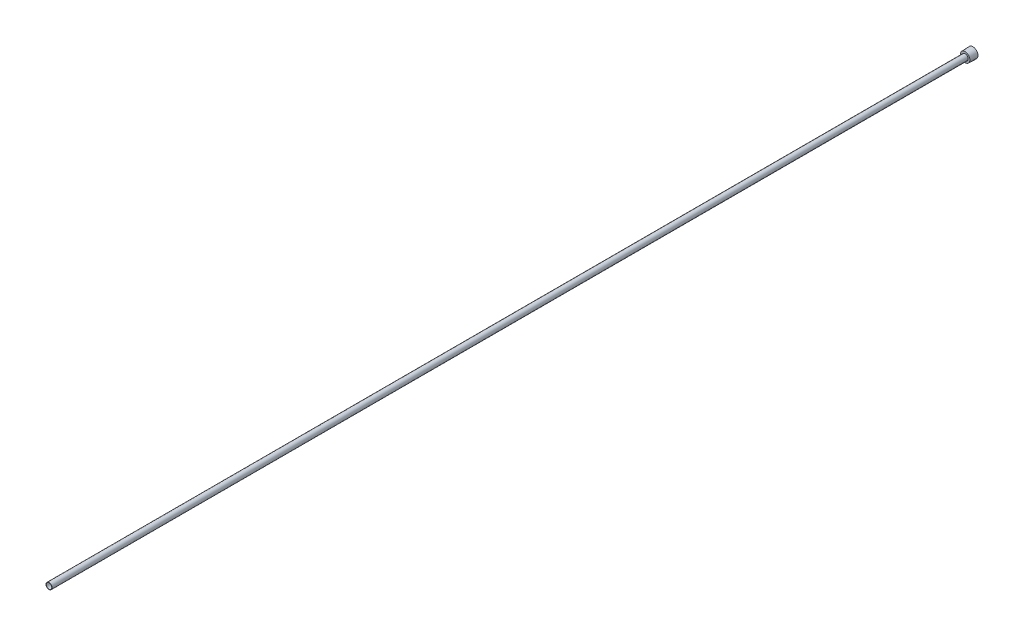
from build123d import *

# Parameters (mm, degrees)
SKETCH2_R          = 3.65125
CUT_EXTRUDE1_DEPTH = 1220.23702007
CUT_EXTRUDE2_DEPTH = 6.35


with BuildPart() as part:
    # Sketch1 → Revolve1 (revolve)
    with BuildSketch(Plane(origin=(0, 0, 0), x_dir=(0, 0, -1), z_dir=(1, 0, 0)), mode=Mode.PRIVATE) as revolve1_sk:
        Polygon((0, 0), (-1219.2, 0), (-1219.2, 3.96875), (-10.3124, 3.96875), (-10.3124, 6.342143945), (0, 6.7183), align=None)
    revolve(revolve1_sk.sketch.rotate(Axis((0, 0, 331.124179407), (0, 0, -1)), 90), axis=Axis((0, 0, 331.124179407), (0, 0, -1)))

    # Sketch2 → Cut-Extrude1 (cut, through all)
    with BuildSketch(Plane.XY.offset(1219.2)):
        Circle(SKETCH2_R)
    extrude(amount=-CUT_EXTRUDE1_DEPTH, mode=Mode.SUBTRACT)

    # Sketch3 → Cut-Extrude2 (cut)
    with BuildSketch(Plane(origin=(0, 0, 0), x_dir=(-1, 0, 0), z_dir=(0, 0, -1))):
        Polygon((-4.7625, -2.749630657), (0, -5.499261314), (4.7625, -2.749630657), (4.7625, 2.749630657), (0, 5.499261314), (-4.7625, 2.749630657), align=None)
    extrude(amount=-CUT_EXTRUDE2_DEPTH, mode=Mode.SUBTRACT)


solid = part.part
